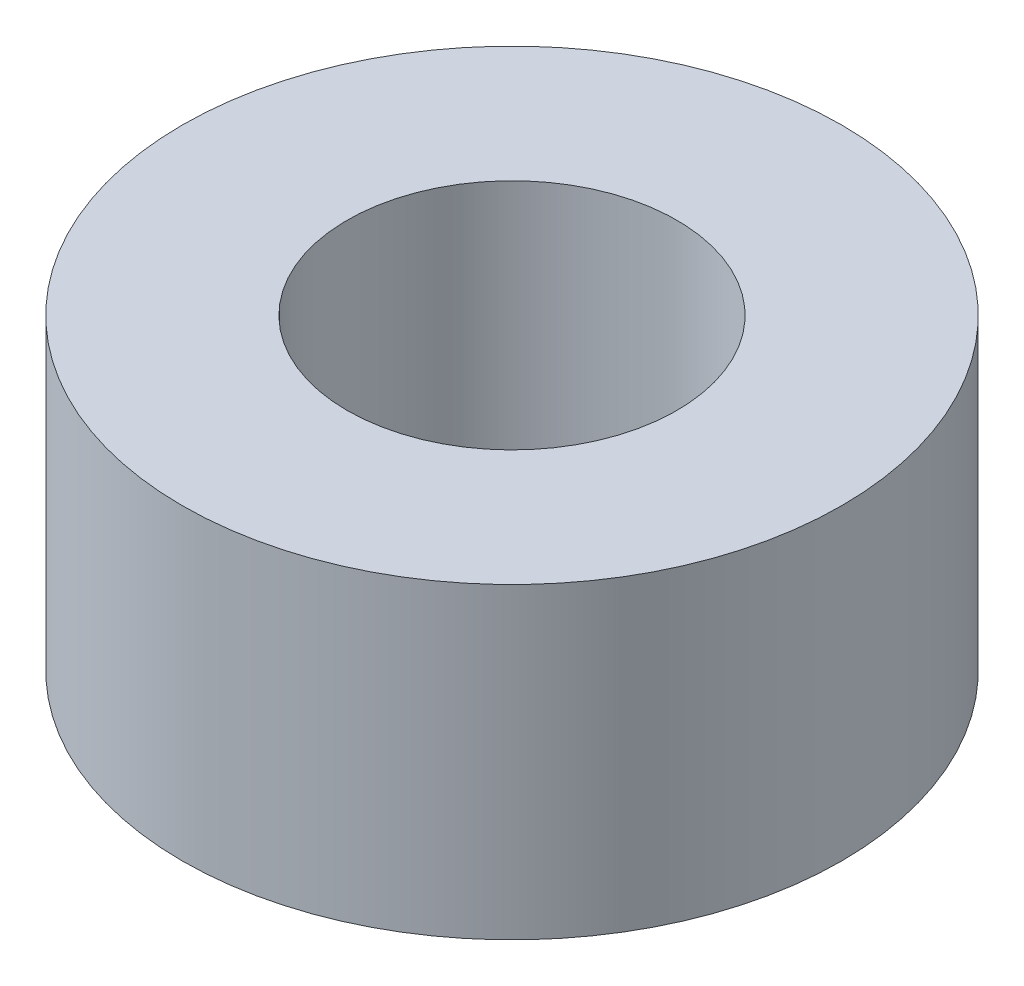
from build123d import *

# Parameters (mm, degrees)
SKETCH1_R      = 9.525
SKETCH1_R_2    = 4.7625
EXTRUDE1_DEPTH = 8.89


with BuildPart() as part:
    # Sketch1 → Extrude1 (new body)
    with BuildSketch(Plane(origin=(0, 0, 0), x_dir=(1, 0, 0), z_dir=(0, 1, 0))):
        with Locations(Location((0, 0, 0), (0, 0, 270))):
            Circle(SKETCH1_R)
        with Locations(Location((0, 0, 0), (0, 0, 270))):
            Circle(SKETCH1_R_2, mode=Mode.SUBTRACT)
    extrude(amount=EXTRUDE1_DEPTH)


solid = part.part
